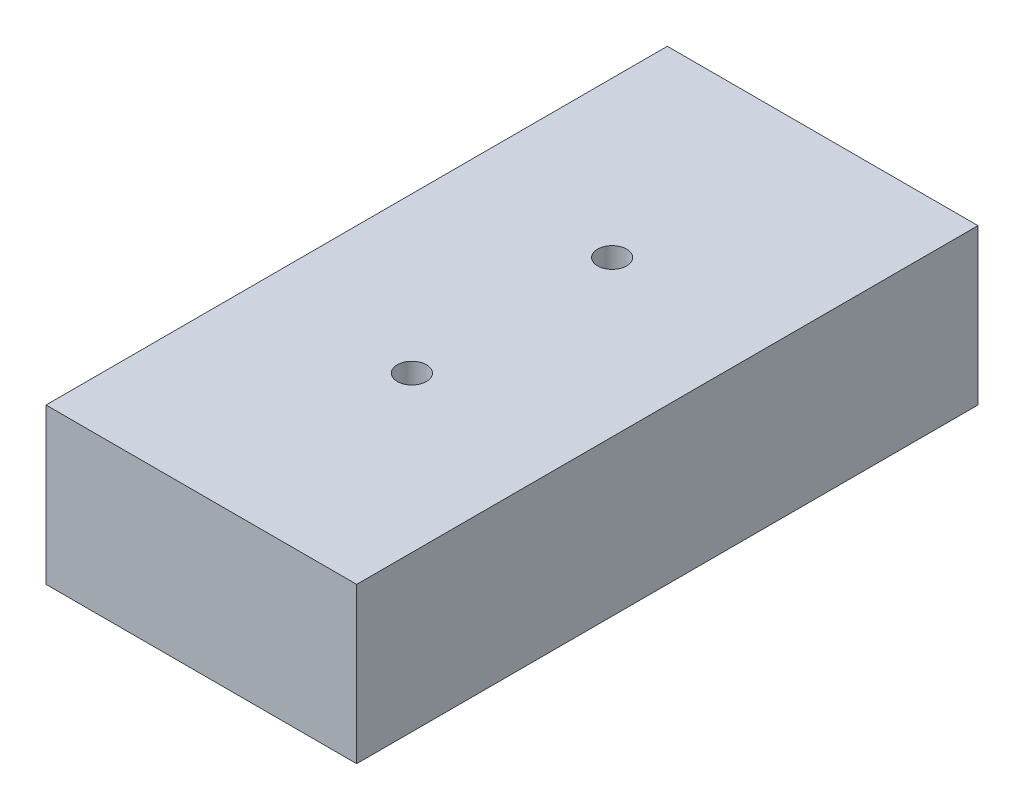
ISO-10303-21;
HEADER;
FILE_DESCRIPTION(('STEP AP214'),'2;1');
FILE_NAME('part.step','',(''),(''),'','','');
FILE_SCHEMA(('AUTOMOTIVE_DESIGN { 1 0 10303 214 1 1 1 1 }'));
ENDSEC;
DATA;
#1=APPLICATION_CONTEXT('core data for automotive mechanical design processes');
#2=APPLICATION_PROTOCOL_DEFINITION('international standard','automotive_design',2000,#1);
#3=PRODUCT_CONTEXT('',#1,'mechanical');
#4=PRODUCT('Part','Part','',(#3));
#5=PRODUCT_RELATED_PRODUCT_CATEGORY('part','',(#4));
#6=PRODUCT_DEFINITION_FORMATION('','',#4);
#7=PRODUCT_DEFINITION_CONTEXT('part definition',#1,'design');
#8=PRODUCT_DEFINITION('design','',#6,#7);
#9=PRODUCT_DEFINITION_SHAPE('','',#8);
#10=(LENGTH_UNIT() NAMED_UNIT(*) SI_UNIT(.MILLI.,.METRE.));
#11=(NAMED_UNIT(*) PLANE_ANGLE_UNIT() SI_UNIT($,.RADIAN.));
#12=(NAMED_UNIT(*) SI_UNIT($,.STERADIAN.) SOLID_ANGLE_UNIT());
#13=UNCERTAINTY_MEASURE_WITH_UNIT(LENGTH_MEASURE(1.E-05),#10,'distance_accuracy_value','');
#14=(GEOMETRIC_REPRESENTATION_CONTEXT(3) GLOBAL_UNCERTAINTY_ASSIGNED_CONTEXT((#13)) GLOBAL_UNIT_ASSIGNED_CONTEXT((#10,
#11,#12)) REPRESENTATION_CONTEXT('',''));
#15=CARTESIAN_POINT('',(0.,0.,0.));
#16=DIRECTION('',(0.,0.,1.));
#17=DIRECTION('',(1.,0.,0.));
#18=AXIS2_PLACEMENT_3D('',#15,#16,#17);
#19=CARTESIAN_POINT('',(-50.8,-25.4,101.6));
#20=DIRECTION('',(1.,0.,0.));
#21=DIRECTION('',(0.,0.,-1.));
#22=AXIS2_PLACEMENT_3D('',#19,#20,#21);
#23=PLANE('',#22);
#24=DIRECTION('',(0.,-1.,0.));
#25=VECTOR('',#24,1.);
#26=CARTESIAN_POINT('',(-50.8,-25.4,-101.6));
#27=LINE('',#26,#25);
#28=CARTESIAN_POINT('',(-50.8,25.4,-101.6));
#29=VERTEX_POINT('',#28);
#30=CARTESIAN_POINT('',(-50.8,-25.4,-101.6));
#31=VERTEX_POINT('',#30);
#32=EDGE_CURVE('E95',#29,#31,#27,.T.);
#33=ORIENTED_EDGE('',*,*,#32,.T.);
#34=DIRECTION('',(0.,0.,-1.));
#35=VECTOR('',#34,1.);
#36=CARTESIAN_POINT('',(-50.8,-25.4,101.6));
#37=LINE('',#36,#35);
#38=CARTESIAN_POINT('',(-50.8,-25.4,101.6));
#39=VERTEX_POINT('',#38);
#40=EDGE_CURVE('E11',#39,#31,#37,.T.);
#41=ORIENTED_EDGE('',*,*,#40,.F.);
#42=DIRECTION('',(0.,-1.,0.));
#43=VECTOR('',#42,1.);
#44=CARTESIAN_POINT('',(-50.8,-25.4,101.6));
#45=LINE('',#44,#43);
#46=CARTESIAN_POINT('',(-50.8,25.4,101.6));
#47=VERTEX_POINT('',#46);
#48=EDGE_CURVE('E83',#47,#39,#45,.T.);
#49=ORIENTED_EDGE('',*,*,#48,.F.);
#50=DIRECTION('',(0.,0.,-1.));
#51=VECTOR('',#50,1.);
#52=CARTESIAN_POINT('',(-50.8,25.4,101.6));
#53=LINE('',#52,#51);
#54=EDGE_CURVE('E91',#47,#29,#53,.T.);
#55=ORIENTED_EDGE('',*,*,#54,.T.);
#56=EDGE_LOOP('',(#33,#41,#49,#55));
#57=FACE_BOUND('',#56,.T.);
#58=ADVANCED_FACE('F32',(#57),#23,.F.);
#59=CARTESIAN_POINT('',(-50.8,-25.4,101.6));
#60=DIRECTION('',(0.,1.,0.));
#61=DIRECTION('',(0.,0.,1.));
#62=AXIS2_PLACEMENT_3D('',#59,#60,#61);
#63=PLANE('',#62);
#64=CARTESIAN_POINT('',(0.,-25.4,32.7509613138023));
#65=DIRECTION('',(0.,1.,0.));
#66=DIRECTION('',(0.,0.,1.));
#67=AXIS2_PLACEMENT_3D('',#64,#65,#66);
#68=CIRCLE('',#67,4.76249999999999);
#69=CARTESIAN_POINT('',(0.,-25.4,37.5134613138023));
#70=VERTEX_POINT('',#69);
#71=EDGE_CURVE('E114',#70,#70,#68,.T.);
#72=ORIENTED_EDGE('',*,*,#71,.T.);
#73=EDGE_LOOP('',(#72));
#74=FACE_BOUND('',#73,.T.);
#75=CARTESIAN_POINT('',(0.,-25.4,-32.7509613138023));
#76=DIRECTION('',(0.,1.,0.));
#77=DIRECTION('',(0.,0.,1.));
#78=AXIS2_PLACEMENT_3D('',#75,#76,#77);
#79=CIRCLE('',#78,4.76249999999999);
#80=CARTESIAN_POINT('',(0.,-25.4,-27.9884613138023));
#81=VERTEX_POINT('',#80);
#82=EDGE_CURVE('E98',#81,#81,#79,.T.);
#83=ORIENTED_EDGE('',*,*,#82,.T.);
#84=EDGE_LOOP('',(#83));
#85=FACE_BOUND('',#84,.T.);
#86=DIRECTION('',(1.,0.,0.));
#87=VECTOR('',#86,1.);
#88=CARTESIAN_POINT('',(-50.8,-25.4,-101.6));
#89=LINE('',#88,#87);
#90=CARTESIAN_POINT('',(50.8,-25.4,-101.6));
#91=VERTEX_POINT('',#90);
#92=EDGE_CURVE('E87',#31,#91,#89,.T.);
#93=ORIENTED_EDGE('',*,*,#92,.T.);
#94=DIRECTION('',(0.,0.,-1.));
#95=VECTOR('',#94,1.);
#96=CARTESIAN_POINT('',(50.8,-25.4,101.6));
#97=LINE('',#96,#95);
#98=CARTESIAN_POINT('',(50.8,-25.4,101.6));
#99=VERTEX_POINT('',#98);
#100=EDGE_CURVE('E40',#99,#91,#97,.T.);
#101=ORIENTED_EDGE('',*,*,#100,.F.);
#102=DIRECTION('',(1.,0.,0.));
#103=VECTOR('',#102,1.);
#104=CARTESIAN_POINT('',(-50.8,-25.4,101.6));
#105=LINE('',#104,#103);
#106=EDGE_CURVE('E78',#39,#99,#105,.T.);
#107=ORIENTED_EDGE('',*,*,#106,.F.);
#108=ORIENTED_EDGE('',*,*,#40,.T.);
#109=EDGE_LOOP('',(#93,#101,#107,#108));
#110=FACE_BOUND('',#109,.T.);
#111=ADVANCED_FACE('F86',(#74,#85,#110),#63,.F.);
#112=CARTESIAN_POINT('',(50.8,-25.4,101.6));
#113=DIRECTION('',(-1.,0.,0.));
#114=DIRECTION('',(0.,0.,1.));
#115=AXIS2_PLACEMENT_3D('',#112,#113,#114);
#116=PLANE('',#115);
#117=DIRECTION('',(0.,1.,0.));
#118=VECTOR('',#117,1.);
#119=CARTESIAN_POINT('',(50.8,-25.4,-101.6));
#120=LINE('',#119,#118);
#121=CARTESIAN_POINT('',(50.8,25.4,-101.6));
#122=VERTEX_POINT('',#121);
#123=EDGE_CURVE('E65',#91,#122,#120,.T.);
#124=ORIENTED_EDGE('',*,*,#123,.T.);
#125=DIRECTION('',(0.,0.,-1.));
#126=VECTOR('',#125,1.);
#127=CARTESIAN_POINT('',(50.8,25.4,101.6));
#128=LINE('',#127,#126);
#129=CARTESIAN_POINT('',(50.8,25.4,101.6));
#130=VERTEX_POINT('',#129);
#131=EDGE_CURVE('E88',#130,#122,#128,.T.);
#132=ORIENTED_EDGE('',*,*,#131,.F.);
#133=DIRECTION('',(0.,1.,0.));
#134=VECTOR('',#133,1.);
#135=CARTESIAN_POINT('',(50.8,-25.4,101.6));
#136=LINE('',#135,#134);
#137=EDGE_CURVE('E81',#99,#130,#136,.T.);
#138=ORIENTED_EDGE('',*,*,#137,.F.);
#139=ORIENTED_EDGE('',*,*,#100,.T.);
#140=EDGE_LOOP('',(#124,#132,#138,#139));
#141=FACE_BOUND('',#140,.T.);
#142=ADVANCED_FACE('F89',(#141),#116,.F.);
#143=CARTESIAN_POINT('',(-50.8,25.4,101.6));
#144=DIRECTION('',(0.,-1.,0.));
#145=DIRECTION('',(0.,0.,-1.));
#146=AXIS2_PLACEMENT_3D('',#143,#144,#145);
#147=PLANE('',#146);
#148=CARTESIAN_POINT('',(0.,25.4,32.7509613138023));
#149=DIRECTION('',(0.,1.,0.));
#150=DIRECTION('',(0.,0.,1.));
#151=AXIS2_PLACEMENT_3D('',#148,#149,#150);
#152=CIRCLE('',#151,4.76249999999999);
#153=CARTESIAN_POINT('',(0.,25.4,37.5134613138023));
#154=VERTEX_POINT('',#153);
#155=EDGE_CURVE('E117',#154,#154,#152,.T.);
#156=ORIENTED_EDGE('',*,*,#155,.F.);
#157=EDGE_LOOP('',(#156));
#158=FACE_BOUND('',#157,.T.);
#159=CARTESIAN_POINT('',(0.,25.4,-32.7509613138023));
#160=DIRECTION('',(0.,1.,0.));
#161=DIRECTION('',(0.,0.,1.));
#162=AXIS2_PLACEMENT_3D('',#159,#160,#161);
#163=CIRCLE('',#162,4.76249999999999);
#164=CARTESIAN_POINT('',(0.,25.4,-27.9884613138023));
#165=VERTEX_POINT('',#164);
#166=EDGE_CURVE('E111',#165,#165,#163,.T.);
#167=ORIENTED_EDGE('',*,*,#166,.F.);
#168=EDGE_LOOP('',(#167));
#169=FACE_BOUND('',#168,.T.);
#170=DIRECTION('',(-1.,0.,0.));
#171=VECTOR('',#170,1.);
#172=CARTESIAN_POINT('',(-50.8,25.4,-101.6));
#173=LINE('',#172,#171);
#174=EDGE_CURVE('E71',#122,#29,#173,.T.);
#175=ORIENTED_EDGE('',*,*,#174,.T.);
#176=ORIENTED_EDGE('',*,*,#54,.F.);
#177=DIRECTION('',(-1.,0.,0.));
#178=VECTOR('',#177,1.);
#179=CARTESIAN_POINT('',(-50.8,25.4,101.6));
#180=LINE('',#179,#178);
#181=EDGE_CURVE('E48',#130,#47,#180,.T.);
#182=ORIENTED_EDGE('',*,*,#181,.F.);
#183=ORIENTED_EDGE('',*,*,#131,.T.);
#184=EDGE_LOOP('',(#175,#176,#182,#183));
#185=FACE_BOUND('',#184,.T.);
#186=ADVANCED_FACE('F103',(#158,#169,#185),#147,.F.);
#187=CARTESIAN_POINT('',(-50.8,25.4,101.6));
#188=DIRECTION('',(0.,0.,-1.));
#189=DIRECTION('',(-1.,0.,0.));
#190=AXIS2_PLACEMENT_3D('',#187,#188,#189);
#191=PLANE('',#190);
#192=ORIENTED_EDGE('',*,*,#48,.T.);
#193=ORIENTED_EDGE('',*,*,#106,.T.);
#194=ORIENTED_EDGE('',*,*,#137,.T.);
#195=ORIENTED_EDGE('',*,*,#181,.T.);
#196=EDGE_LOOP('',(#192,#193,#194,#195));
#197=FACE_BOUND('',#196,.T.);
#198=ADVANCED_FACE('F79',(#197),#191,.F.);
#199=CARTESIAN_POINT('',(-50.8,25.4,-101.6));
#200=DIRECTION('',(0.,0.,-1.));
#201=DIRECTION('',(-1.,0.,0.));
#202=AXIS2_PLACEMENT_3D('',#199,#200,#201);
#203=PLANE('',#202);
#204=ORIENTED_EDGE('',*,*,#32,.F.);
#205=ORIENTED_EDGE('',*,*,#174,.F.);
#206=ORIENTED_EDGE('',*,*,#123,.F.);
#207=ORIENTED_EDGE('',*,*,#92,.F.);
#208=EDGE_LOOP('',(#204,#205,#206,#207));
#209=FACE_BOUND('',#208,.T.);
#210=ADVANCED_FACE('F106',(#209),#203,.T.);
#211=CARTESIAN_POINT('',(0.,25.4,-32.7509613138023));
#212=DIRECTION('',(0.,1.,0.));
#213=DIRECTION('',(0.,0.,1.));
#214=AXIS2_PLACEMENT_3D('',#211,#212,#213);
#215=CYLINDRICAL_SURFACE('',#214,4.76249999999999);
#216=ORIENTED_EDGE('',*,*,#82,.F.);
#217=EDGE_LOOP('',(#216));
#218=FACE_BOUND('',#217,.T.);
#219=ORIENTED_EDGE('',*,*,#166,.T.);
#220=EDGE_LOOP('',(#219));
#221=FACE_BOUND('',#220,.T.);
#222=ADVANCED_FACE('F128',(#218,#221),#215,.F.);
#223=CARTESIAN_POINT('',(0.,25.4,32.7509613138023));
#224=DIRECTION('',(0.,1.,0.));
#225=DIRECTION('',(0.,0.,1.));
#226=AXIS2_PLACEMENT_3D('',#223,#224,#225);
#227=CYLINDRICAL_SURFACE('',#226,4.76249999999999);
#228=ORIENTED_EDGE('',*,*,#71,.F.);
#229=EDGE_LOOP('',(#228));
#230=FACE_BOUND('',#229,.T.);
#231=ORIENTED_EDGE('',*,*,#155,.T.);
#232=EDGE_LOOP('',(#231));
#233=FACE_BOUND('',#232,.T.);
#234=ADVANCED_FACE('F121',(#230,#233),#227,.F.);
#235=CLOSED_SHELL('',(#58,#111,#142,#186,#198,#210,#222,#234));
#236=MANIFOLD_SOLID_BREP('B2',#235);
#237=ADVANCED_BREP_SHAPE_REPRESENTATION('',(#18,#236),#14);
#238=SHAPE_DEFINITION_REPRESENTATION(#9,#237);
ENDSEC;
END-ISO-10303-21;
